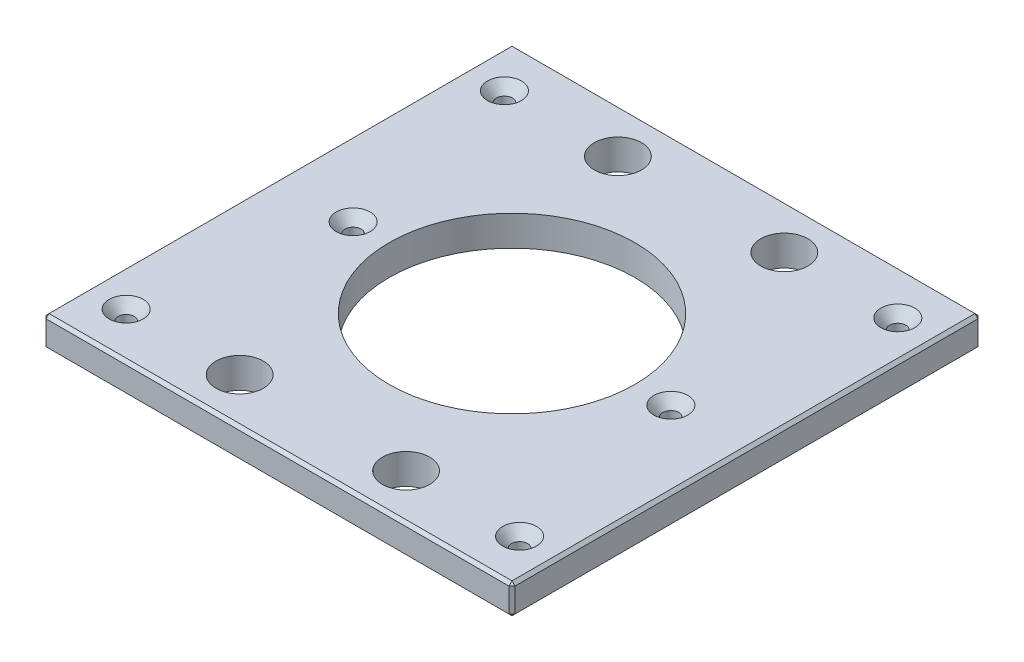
ISO-10303-21;
HEADER;
FILE_DESCRIPTION(('STEP AP214'),'2;1');
FILE_NAME('part.step','',(''),(''),'','','');
FILE_SCHEMA(('AUTOMOTIVE_DESIGN { 1 0 10303 214 1 1 1 1 }'));
ENDSEC;
DATA;
#1=APPLICATION_CONTEXT('core data for automotive mechanical design processes');
#2=APPLICATION_PROTOCOL_DEFINITION('international standard','automotive_design',2000,#1);
#3=PRODUCT_CONTEXT('',#1,'mechanical');
#4=PRODUCT('Part','Part','',(#3));
#5=PRODUCT_RELATED_PRODUCT_CATEGORY('part','',(#4));
#6=PRODUCT_DEFINITION_FORMATION('','',#4);
#7=PRODUCT_DEFINITION_CONTEXT('part definition',#1,'design');
#8=PRODUCT_DEFINITION('design','',#6,#7);
#9=PRODUCT_DEFINITION_SHAPE('','',#8);
#10=(LENGTH_UNIT() NAMED_UNIT(*) SI_UNIT(.MILLI.,.METRE.));
#11=(NAMED_UNIT(*) PLANE_ANGLE_UNIT() SI_UNIT($,.RADIAN.));
#12=(NAMED_UNIT(*) SI_UNIT($,.STERADIAN.) SOLID_ANGLE_UNIT());
#13=UNCERTAINTY_MEASURE_WITH_UNIT(LENGTH_MEASURE(1.E-05),#10,'distance_accuracy_value','');
#14=(GEOMETRIC_REPRESENTATION_CONTEXT(3) GLOBAL_UNCERTAINTY_ASSIGNED_CONTEXT((#13)) GLOBAL_UNIT_ASSIGNED_CONTEXT((#10,
#11,#12)) REPRESENTATION_CONTEXT('',''));
#15=CARTESIAN_POINT('',(0.,0.,0.));
#16=DIRECTION('',(0.,0.,1.));
#17=DIRECTION('',(1.,0.,0.));
#18=AXIS2_PLACEMENT_3D('',#15,#16,#17);
#19=CARTESIAN_POINT('',(-98.425,12.7,-98.425));
#20=DIRECTION('',(1.,0.,0.));
#21=DIRECTION('',(0.,0.,-1.));
#22=AXIS2_PLACEMENT_3D('',#19,#20,#21);
#23=PLANE('',#22);
#24=DIRECTION('',(0.,0.,-1.));
#25=VECTOR('',#24,1.);
#26=CARTESIAN_POINT('',(-98.425,11.43,-98.425));
#27=LINE('',#26,#25);
#28=CARTESIAN_POINT('',(-98.425,11.43,97.155));
#29=VERTEX_POINT('',#28);
#30=CARTESIAN_POINT('',(-98.425,11.43,-97.155));
#31=VERTEX_POINT('',#30);
#32=EDGE_CURVE('E142',#29,#31,#27,.T.);
#33=ORIENTED_EDGE('',*,*,#32,.T.);
#34=DIRECTION('',(0.,-1.,0.));
#35=VECTOR('',#34,1.);
#36=CARTESIAN_POINT('',(-98.425,12.7,-97.155));
#37=LINE('',#36,#35);
#38=CARTESIAN_POINT('',(-98.425,1.26999999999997,-97.155));
#39=VERTEX_POINT('',#38);
#40=EDGE_CURVE('E137',#31,#39,#37,.T.);
#41=ORIENTED_EDGE('',*,*,#40,.T.);
#42=DIRECTION('',(0.,0.,1.));
#43=VECTOR('',#42,1.);
#44=CARTESIAN_POINT('',(-98.425,1.26999999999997,-98.425));
#45=LINE('',#44,#43);
#46=CARTESIAN_POINT('',(-98.425,1.26999999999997,97.155));
#47=VERTEX_POINT('',#46);
#48=EDGE_CURVE('E132',#39,#47,#45,.T.);
#49=ORIENTED_EDGE('',*,*,#48,.T.);
#50=DIRECTION('',(0.,1.,0.));
#51=VECTOR('',#50,1.);
#52=CARTESIAN_POINT('',(-98.425,12.7,97.155));
#53=LINE('',#52,#51);
#54=EDGE_CURVE('E134',#47,#29,#53,.T.);
#55=ORIENTED_EDGE('',*,*,#54,.T.);
#56=EDGE_LOOP('',(#33,#41,#49,#55));
#57=FACE_BOUND('',#56,.T.);
#58=ADVANCED_FACE('F40',(#57),#23,.F.);
#59=CARTESIAN_POINT('',(-98.425,12.7,98.425));
#60=DIRECTION('',(0.,0.,-1.));
#61=DIRECTION('',(-1.,0.,0.));
#62=AXIS2_PLACEMENT_3D('',#59,#60,#61);
#63=PLANE('',#62);
#64=DIRECTION('',(1.,0.,0.));
#65=VECTOR('',#64,1.);
#66=CARTESIAN_POINT('',(-98.425,1.26999999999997,98.425));
#67=LINE('',#66,#65);
#68=CARTESIAN_POINT('',(-97.1550000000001,1.26999999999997,98.425));
#69=VERTEX_POINT('',#68);
#70=CARTESIAN_POINT('',(97.1550000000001,1.26999999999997,98.425));
#71=VERTEX_POINT('',#70);
#72=EDGE_CURVE('E64',#69,#71,#67,.T.);
#73=ORIENTED_EDGE('',*,*,#72,.T.);
#74=DIRECTION('',(0.,1.,0.));
#75=VECTOR('',#74,1.);
#76=CARTESIAN_POINT('',(97.1550000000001,12.7,98.425));
#77=LINE('',#76,#75);
#78=CARTESIAN_POINT('',(97.1550000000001,11.43,98.425));
#79=VERTEX_POINT('',#78);
#80=EDGE_CURVE('E11',#71,#79,#77,.T.);
#81=ORIENTED_EDGE('',*,*,#80,.T.);
#82=DIRECTION('',(-1.,0.,0.));
#83=VECTOR('',#82,1.);
#84=CARTESIAN_POINT('',(-98.425,11.43,98.425));
#85=LINE('',#84,#83);
#86=CARTESIAN_POINT('',(-97.1550000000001,11.43,98.425));
#87=VERTEX_POINT('',#86);
#88=EDGE_CURVE('E50',#79,#87,#85,.T.);
#89=ORIENTED_EDGE('',*,*,#88,.T.);
#90=DIRECTION('',(0.,-1.,0.));
#91=VECTOR('',#90,1.);
#92=CARTESIAN_POINT('',(-97.1550000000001,12.7,98.425));
#93=LINE('',#92,#91);
#94=EDGE_CURVE('E333',#87,#69,#93,.T.);
#95=ORIENTED_EDGE('',*,*,#94,.T.);
#96=EDGE_LOOP('',(#73,#81,#89,#95));
#97=FACE_BOUND('',#96,.T.);
#98=ADVANCED_FACE('F411',(#97),#63,.F.);
#99=CARTESIAN_POINT('',(98.425,12.7,-98.425));
#100=DIRECTION('',(-1.,0.,0.));
#101=DIRECTION('',(0.,0.,1.));
#102=AXIS2_PLACEMENT_3D('',#99,#100,#101);
#103=PLANE('',#102);
#104=DIRECTION('',(0.,0.,-1.));
#105=VECTOR('',#104,1.);
#106=CARTESIAN_POINT('',(98.425,1.26999999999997,-98.425));
#107=LINE('',#106,#105);
#108=CARTESIAN_POINT('',(98.425,1.26999999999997,97.155));
#109=VERTEX_POINT('',#108);
#110=CARTESIAN_POINT('',(98.425,1.26999999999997,-97.155));
#111=VERTEX_POINT('',#110);
#112=EDGE_CURVE('E326',#109,#111,#107,.T.);
#113=ORIENTED_EDGE('',*,*,#112,.T.);
#114=DIRECTION('',(0.,1.,0.));
#115=VECTOR('',#114,1.);
#116=CARTESIAN_POINT('',(98.425,12.7,-97.155));
#117=LINE('',#116,#115);
#118=CARTESIAN_POINT('',(98.425,11.43,-97.155));
#119=VERTEX_POINT('',#118);
#120=EDGE_CURVE('E329',#111,#119,#117,.T.);
#121=ORIENTED_EDGE('',*,*,#120,.T.);
#122=DIRECTION('',(0.,0.,1.));
#123=VECTOR('',#122,1.);
#124=CARTESIAN_POINT('',(98.425,11.43,98.425));
#125=LINE('',#124,#123);
#126=CARTESIAN_POINT('',(98.425,11.43,97.155));
#127=VERTEX_POINT('',#126);
#128=EDGE_CURVE('E323',#119,#127,#125,.T.);
#129=ORIENTED_EDGE('',*,*,#128,.T.);
#130=DIRECTION('',(0.,-1.,0.));
#131=VECTOR('',#130,1.);
#132=CARTESIAN_POINT('',(98.425,12.7,97.155));
#133=LINE('',#132,#131);
#134=EDGE_CURVE('E320',#127,#109,#133,.T.);
#135=ORIENTED_EDGE('',*,*,#134,.T.);
#136=EDGE_LOOP('',(#113,#121,#129,#135));
#137=FACE_BOUND('',#136,.T.);
#138=ADVANCED_FACE('F398',(#137),#103,.F.);
#139=CARTESIAN_POINT('',(-98.425,12.7,-98.425));
#140=DIRECTION('',(0.,0.,1.));
#141=DIRECTION('',(1.,0.,0.));
#142=AXIS2_PLACEMENT_3D('',#139,#140,#141);
#143=PLANE('',#142);
#144=DIRECTION('',(-1.,0.,0.));
#145=VECTOR('',#144,1.);
#146=CARTESIAN_POINT('',(-98.425,1.26999999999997,-98.425));
#147=LINE('',#146,#145);
#148=CARTESIAN_POINT('',(97.1550000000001,1.26999999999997,-98.425));
#149=VERTEX_POINT('',#148);
#150=CARTESIAN_POINT('',(-97.1550000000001,1.26999999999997,-98.425));
#151=VERTEX_POINT('',#150);
#152=EDGE_CURVE('E287',#149,#151,#147,.T.);
#153=ORIENTED_EDGE('',*,*,#152,.T.);
#154=DIRECTION('',(0.,1.,0.));
#155=VECTOR('',#154,1.);
#156=CARTESIAN_POINT('',(-97.1550000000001,12.7,-98.425));
#157=LINE('',#156,#155);
#158=CARTESIAN_POINT('',(-97.1550000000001,11.43,-98.425));
#159=VERTEX_POINT('',#158);
#160=EDGE_CURVE('E293',#151,#159,#157,.T.);
#161=ORIENTED_EDGE('',*,*,#160,.T.);
#162=DIRECTION('',(1.,0.,0.));
#163=VECTOR('',#162,1.);
#164=CARTESIAN_POINT('',(98.425,11.43,-98.425));
#165=LINE('',#164,#163);
#166=CARTESIAN_POINT('',(97.1550000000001,11.43,-98.425));
#167=VERTEX_POINT('',#166);
#168=EDGE_CURVE('E290',#159,#167,#165,.T.);
#169=ORIENTED_EDGE('',*,*,#168,.T.);
#170=DIRECTION('',(0.,-1.,0.));
#171=VECTOR('',#170,1.);
#172=CARTESIAN_POINT('',(97.1550000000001,12.7,-98.425));
#173=LINE('',#172,#171);
#174=EDGE_CURVE('E284',#167,#149,#173,.T.);
#175=ORIENTED_EDGE('',*,*,#174,.T.);
#176=EDGE_LOOP('',(#153,#161,#169,#175));
#177=FACE_BOUND('',#176,.T.);
#178=ADVANCED_FACE('F372',(#177),#143,.F.);
#179=CARTESIAN_POINT('',(0.,12.7,0.));
#180=DIRECTION('',(0.,1.,0.));
#181=DIRECTION('',(0.,0.,1.));
#182=AXIS2_PLACEMENT_3D('',#179,#180,#181);
#183=PLANE('',#182);
#184=CARTESIAN_POINT('',(82.55,12.7,-79.375));
#185=DIRECTION('',(0.,1.,0.));
#186=DIRECTION('',(0.,0.,1.));
#187=AXIS2_PLACEMENT_3D('',#184,#185,#186);
#188=CIRCLE('',#187,7.1374);
#189=CARTESIAN_POINT('',(82.55,12.7,-72.2376));
#190=VERTEX_POINT('',#189);
#191=EDGE_CURVE('E879',#190,#190,#188,.T.);
#192=ORIENTED_EDGE('',*,*,#191,.F.);
#193=EDGE_LOOP('',(#192));
#194=FACE_BOUND('',#193,.T.);
#195=CARTESIAN_POINT('',(82.55,12.7,79.375));
#196=DIRECTION('',(0.,1.,0.));
#197=DIRECTION('',(0.,0.,1.));
#198=AXIS2_PLACEMENT_3D('',#195,#196,#197);
#199=CIRCLE('',#198,7.1374);
#200=CARTESIAN_POINT('',(82.55,12.7,86.5124));
#201=VERTEX_POINT('',#200);
#202=EDGE_CURVE('E883',#201,#201,#199,.T.);
#203=ORIENTED_EDGE('',*,*,#202,.F.);
#204=EDGE_LOOP('',(#203));
#205=FACE_BOUND('',#204,.T.);
#206=CARTESIAN_POINT('',(-82.55,12.7,79.375));
#207=DIRECTION('',(0.,1.,0.));
#208=DIRECTION('',(0.,0.,1.));
#209=AXIS2_PLACEMENT_3D('',#206,#207,#208);
#210=CIRCLE('',#209,7.1374);
#211=CARTESIAN_POINT('',(-82.55,12.7,86.5124));
#212=VERTEX_POINT('',#211);
#213=EDGE_CURVE('E887',#212,#212,#210,.T.);
#214=ORIENTED_EDGE('',*,*,#213,.F.);
#215=EDGE_LOOP('',(#214));
#216=FACE_BOUND('',#215,.T.);
#217=CARTESIAN_POINT('',(-66.675,12.7,0.));
#218=DIRECTION('',(0.,1.,0.));
#219=DIRECTION('',(0.,0.,1.));
#220=AXIS2_PLACEMENT_3D('',#217,#218,#219);
#221=CIRCLE('',#220,7.1374);
#222=CARTESIAN_POINT('',(-66.675,12.7,7.1374));
#223=VERTEX_POINT('',#222);
#224=EDGE_CURVE('E891',#223,#223,#221,.T.);
#225=ORIENTED_EDGE('',*,*,#224,.F.);
#226=EDGE_LOOP('',(#225));
#227=FACE_BOUND('',#226,.T.);
#228=CARTESIAN_POINT('',(66.675,12.7,0.));
#229=DIRECTION('',(0.,1.,0.));
#230=DIRECTION('',(0.,0.,1.));
#231=AXIS2_PLACEMENT_3D('',#228,#229,#230);
#232=CIRCLE('',#231,7.1374);
#233=CARTESIAN_POINT('',(66.675,12.7,7.1374));
#234=VERTEX_POINT('',#233);
#235=EDGE_CURVE('E895',#234,#234,#232,.T.);
#236=ORIENTED_EDGE('',*,*,#235,.F.);
#237=EDGE_LOOP('',(#236));
#238=FACE_BOUND('',#237,.T.);
#239=CARTESIAN_POINT('',(-82.55,12.7,-79.375));
#240=DIRECTION('',(0.,1.,0.));
#241=DIRECTION('',(0.,0.,1.));
#242=AXIS2_PLACEMENT_3D('',#239,#240,#241);
#243=CIRCLE('',#242,7.1374);
#244=CARTESIAN_POINT('',(-82.55,12.7,-72.2376));
#245=VERTEX_POINT('',#244);
#246=EDGE_CURVE('E898',#245,#245,#243,.T.);
#247=ORIENTED_EDGE('',*,*,#246,.F.);
#248=EDGE_LOOP('',(#247));
#249=FACE_BOUND('',#248,.T.);
#250=DIRECTION('',(0.,0.,-1.));
#251=VECTOR('',#250,1.);
#252=CARTESIAN_POINT('',(97.1550000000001,12.7,-98.425));
#253=LINE('',#252,#251);
#254=CARTESIAN_POINT('',(97.1550000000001,12.7,97.155));
#255=VERTEX_POINT('',#254);
#256=CARTESIAN_POINT('',(97.1550000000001,12.7,-97.155));
#257=VERTEX_POINT('',#256);
#258=EDGE_CURVE('E302',#255,#257,#253,.T.);
#259=ORIENTED_EDGE('',*,*,#258,.T.);
#260=DIRECTION('',(-1.,0.,0.));
#261=VECTOR('',#260,1.);
#262=CARTESIAN_POINT('',(-98.425,12.7,-97.155));
#263=LINE('',#262,#261);
#264=CARTESIAN_POINT('',(-97.1550000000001,12.7,-97.155));
#265=VERTEX_POINT('',#264);
#266=EDGE_CURVE('E305',#257,#265,#263,.T.);
#267=ORIENTED_EDGE('',*,*,#266,.T.);
#268=DIRECTION('',(0.,0.,1.));
#269=VECTOR('',#268,1.);
#270=CARTESIAN_POINT('',(-97.1550000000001,12.7,98.425));
#271=LINE('',#270,#269);
#272=CARTESIAN_POINT('',(-97.1550000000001,12.7,97.155));
#273=VERTEX_POINT('',#272);
#274=EDGE_CURVE('E299',#265,#273,#271,.T.);
#275=ORIENTED_EDGE('',*,*,#274,.T.);
#276=DIRECTION('',(1.,0.,0.));
#277=VECTOR('',#276,1.);
#278=CARTESIAN_POINT('',(98.425,12.7,97.155));
#279=LINE('',#278,#277);
#280=EDGE_CURVE('E296',#273,#255,#279,.T.);
#281=ORIENTED_EDGE('',*,*,#280,.T.);
#282=EDGE_LOOP('',(#259,#267,#275,#281));
#283=FACE_BOUND('',#282,.T.);
#284=CARTESIAN_POINT('',(34.925,12.7,-79.375));
#285=DIRECTION('',(0.,1.,0.));
#286=DIRECTION('',(0.,0.,1.));
#287=AXIS2_PLACEMENT_3D('',#284,#285,#286);
#288=CIRCLE('',#287,9.921875);
#289=CARTESIAN_POINT('',(34.925,12.7,-69.453125));
#290=VERTEX_POINT('',#289);
#291=EDGE_CURVE('E232',#290,#290,#288,.T.);
#292=ORIENTED_EDGE('',*,*,#291,.F.);
#293=EDGE_LOOP('',(#292));
#294=FACE_BOUND('',#293,.T.);
#295=CARTESIAN_POINT('',(-34.925,12.7,-79.375));
#296=DIRECTION('',(0.,1.,0.));
#297=DIRECTION('',(0.,0.,1.));
#298=AXIS2_PLACEMENT_3D('',#295,#296,#297);
#299=CIRCLE('',#298,9.921875);
#300=CARTESIAN_POINT('',(-34.925,12.7,-69.453125));
#301=VERTEX_POINT('',#300);
#302=EDGE_CURVE('E247',#301,#301,#299,.T.);
#303=ORIENTED_EDGE('',*,*,#302,.F.);
#304=EDGE_LOOP('',(#303));
#305=FACE_BOUND('',#304,.T.);
#306=CARTESIAN_POINT('',(34.925,12.7,79.375));
#307=DIRECTION('',(0.,1.,0.));
#308=DIRECTION('',(0.,0.,1.));
#309=AXIS2_PLACEMENT_3D('',#306,#307,#308);
#310=CIRCLE('',#309,9.921875);
#311=CARTESIAN_POINT('',(34.925,12.7,89.296875));
#312=VERTEX_POINT('',#311);
#313=EDGE_CURVE('E260',#312,#312,#310,.T.);
#314=ORIENTED_EDGE('',*,*,#313,.F.);
#315=EDGE_LOOP('',(#314));
#316=FACE_BOUND('',#315,.T.);
#317=CARTESIAN_POINT('',(-34.925,12.7,79.375));
#318=DIRECTION('',(0.,1.,0.));
#319=DIRECTION('',(0.,0.,1.));
#320=AXIS2_PLACEMENT_3D('',#317,#318,#319);
#321=CIRCLE('',#320,9.921875);
#322=CARTESIAN_POINT('',(-34.925,12.7,89.296875));
#323=VERTEX_POINT('',#322);
#324=EDGE_CURVE('E267',#323,#323,#321,.T.);
#325=ORIENTED_EDGE('',*,*,#324,.F.);
#326=EDGE_LOOP('',(#325));
#327=FACE_BOUND('',#326,.T.);
#328=CARTESIAN_POINT('',(0.,12.7,0.));
#329=DIRECTION('',(0.,1.,0.));
#330=DIRECTION('',(0.,0.,1.));
#331=AXIS2_PLACEMENT_3D('',#328,#329,#330);
#332=CIRCLE('',#331,51.562);
#333=CARTESIAN_POINT('',(0.,12.7,51.562));
#334=VERTEX_POINT('',#333);
#335=EDGE_CURVE('E274',#334,#334,#332,.T.);
#336=ORIENTED_EDGE('',*,*,#335,.F.);
#337=EDGE_LOOP('',(#336));
#338=FACE_BOUND('',#337,.T.);
#339=ADVANCED_FACE('F420',(#194,#205,#216,#227,#238,#249,#283,#294,#305,#316,#327,#338),#183,.T.);
#340=CARTESIAN_POINT('',(0.,0.,0.));
#341=DIRECTION('',(0.,1.,0.));
#342=DIRECTION('',(0.,0.,1.));
#343=AXIS2_PLACEMENT_3D('',#340,#341,#342);
#344=PLANE('',#343);
#345=CARTESIAN_POINT('',(82.55,0.,-79.375));
#346=DIRECTION('',(0.,1.,0.));
#347=DIRECTION('',(0.,0.,1.));
#348=AXIS2_PLACEMENT_3D('',#345,#346,#347);
#349=CIRCLE('',#348,3.3782);
#350=CARTESIAN_POINT('',(82.55,0.,-75.9968));
#351=VERTEX_POINT('',#350);
#352=EDGE_CURVE('E946',#351,#351,#349,.T.);
#353=ORIENTED_EDGE('',*,*,#352,.T.);
#354=EDGE_LOOP('',(#353));
#355=FACE_BOUND('',#354,.T.);
#356=CARTESIAN_POINT('',(82.55,0.,79.375));
#357=DIRECTION('',(0.,1.,0.));
#358=DIRECTION('',(0.,0.,1.));
#359=AXIS2_PLACEMENT_3D('',#356,#357,#358);
#360=CIRCLE('',#359,3.3782);
#361=CARTESIAN_POINT('',(82.55,0.,82.7532));
#362=VERTEX_POINT('',#361);
#363=EDGE_CURVE('E937',#362,#362,#360,.T.);
#364=ORIENTED_EDGE('',*,*,#363,.T.);
#365=EDGE_LOOP('',(#364));
#366=FACE_BOUND('',#365,.T.);
#367=CARTESIAN_POINT('',(-82.55,0.,79.375));
#368=DIRECTION('',(0.,1.,0.));
#369=DIRECTION('',(0.,0.,1.));
#370=AXIS2_PLACEMENT_3D('',#367,#368,#369);
#371=CIRCLE('',#370,3.3782);
#372=CARTESIAN_POINT('',(-82.55,0.,82.7532));
#373=VERTEX_POINT('',#372);
#374=EDGE_CURVE('E927',#373,#373,#371,.T.);
#375=ORIENTED_EDGE('',*,*,#374,.T.);
#376=EDGE_LOOP('',(#375));
#377=FACE_BOUND('',#376,.T.);
#378=CARTESIAN_POINT('',(-66.675,0.,0.));
#379=DIRECTION('',(0.,1.,0.));
#380=DIRECTION('',(0.,0.,1.));
#381=AXIS2_PLACEMENT_3D('',#378,#379,#380);
#382=CIRCLE('',#381,3.3782);
#383=CARTESIAN_POINT('',(-66.675,0.,3.3782));
#384=VERTEX_POINT('',#383);
#385=EDGE_CURVE('E917',#384,#384,#382,.T.);
#386=ORIENTED_EDGE('',*,*,#385,.T.);
#387=EDGE_LOOP('',(#386));
#388=FACE_BOUND('',#387,.T.);
#389=CARTESIAN_POINT('',(66.675,0.,0.));
#390=DIRECTION('',(0.,1.,0.));
#391=DIRECTION('',(0.,0.,1.));
#392=AXIS2_PLACEMENT_3D('',#389,#390,#391);
#393=CIRCLE('',#392,3.3782);
#394=CARTESIAN_POINT('',(66.675,0.,3.3782));
#395=VERTEX_POINT('',#394);
#396=EDGE_CURVE('E902',#395,#395,#393,.T.);
#397=ORIENTED_EDGE('',*,*,#396,.T.);
#398=EDGE_LOOP('',(#397));
#399=FACE_BOUND('',#398,.T.);
#400=CARTESIAN_POINT('',(-82.55,0.,-79.375));
#401=DIRECTION('',(0.,1.,0.));
#402=DIRECTION('',(0.,0.,1.));
#403=AXIS2_PLACEMENT_3D('',#400,#401,#402);
#404=CIRCLE('',#403,3.3782);
#405=CARTESIAN_POINT('',(-82.55,0.,-75.9968));
#406=VERTEX_POINT('',#405);
#407=EDGE_CURVE('E250',#406,#406,#404,.T.);
#408=ORIENTED_EDGE('',*,*,#407,.T.);
#409=EDGE_LOOP('',(#408));
#410=FACE_BOUND('',#409,.T.);
#411=DIRECTION('',(0.,0.,-1.));
#412=VECTOR('',#411,1.);
#413=CARTESIAN_POINT('',(-97.1550000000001,0.,0.));
#414=LINE('',#413,#412);
#415=CARTESIAN_POINT('',(-97.1550000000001,0.,97.155));
#416=VERTEX_POINT('',#415);
#417=CARTESIAN_POINT('',(-97.1550000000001,0.,-97.155));
#418=VERTEX_POINT('',#417);
#419=EDGE_CURVE('E167',#416,#418,#414,.T.);
#420=ORIENTED_EDGE('',*,*,#419,.T.);
#421=DIRECTION('',(1.,0.,0.));
#422=VECTOR('',#421,1.);
#423=CARTESIAN_POINT('',(0.,0.,-97.155));
#424=LINE('',#423,#422);
#425=CARTESIAN_POINT('',(97.1550000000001,0.,-97.155));
#426=VERTEX_POINT('',#425);
#427=EDGE_CURVE('E317',#418,#426,#424,.T.);
#428=ORIENTED_EDGE('',*,*,#427,.T.);
#429=DIRECTION('',(0.,0.,1.));
#430=VECTOR('',#429,1.);
#431=CARTESIAN_POINT('',(97.1550000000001,0.,0.));
#432=LINE('',#431,#430);
#433=CARTESIAN_POINT('',(97.1550000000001,0.,97.155));
#434=VERTEX_POINT('',#433);
#435=EDGE_CURVE('E314',#426,#434,#432,.T.);
#436=ORIENTED_EDGE('',*,*,#435,.T.);
#437=DIRECTION('',(-1.,0.,0.));
#438=VECTOR('',#437,1.);
#439=CARTESIAN_POINT('',(0.,0.,97.155));
#440=LINE('',#439,#438);
#441=EDGE_CURVE('E309',#434,#416,#440,.T.);
#442=ORIENTED_EDGE('',*,*,#441,.T.);
#443=EDGE_LOOP('',(#420,#428,#436,#442));
#444=FACE_BOUND('',#443,.T.);
#445=CARTESIAN_POINT('',(34.925,0.,-79.375));
#446=DIRECTION('',(0.,1.,0.));
#447=DIRECTION('',(0.,0.,1.));
#448=AXIS2_PLACEMENT_3D('',#445,#446,#447);
#449=CIRCLE('',#448,9.921875);
#450=CARTESIAN_POINT('',(34.925,0.,-69.453125));
#451=VERTEX_POINT('',#450);
#452=EDGE_CURVE('E239',#451,#451,#449,.T.);
#453=ORIENTED_EDGE('',*,*,#452,.T.);
#454=EDGE_LOOP('',(#453));
#455=FACE_BOUND('',#454,.T.);
#456=CARTESIAN_POINT('',(-34.925,0.,-79.375));
#457=DIRECTION('',(0.,1.,0.));
#458=DIRECTION('',(0.,0.,1.));
#459=AXIS2_PLACEMENT_3D('',#456,#457,#458);
#460=CIRCLE('',#459,9.921875);
#461=CARTESIAN_POINT('',(-34.925,0.,-69.453125));
#462=VERTEX_POINT('',#461);
#463=EDGE_CURVE('E256',#462,#462,#460,.T.);
#464=ORIENTED_EDGE('',*,*,#463,.T.);
#465=EDGE_LOOP('',(#464));
#466=FACE_BOUND('',#465,.T.);
#467=CARTESIAN_POINT('',(34.925,0.,79.375));
#468=DIRECTION('',(0.,1.,0.));
#469=DIRECTION('',(0.,0.,1.));
#470=AXIS2_PLACEMENT_3D('',#467,#468,#469);
#471=CIRCLE('',#470,9.921875);
#472=CARTESIAN_POINT('',(34.925,0.,89.296875));
#473=VERTEX_POINT('',#472);
#474=EDGE_CURVE('E263',#473,#473,#471,.T.);
#475=ORIENTED_EDGE('',*,*,#474,.T.);
#476=EDGE_LOOP('',(#475));
#477=FACE_BOUND('',#476,.T.);
#478=CARTESIAN_POINT('',(-34.925,0.,79.375));
#479=DIRECTION('',(0.,1.,0.));
#480=DIRECTION('',(0.,0.,1.));
#481=AXIS2_PLACEMENT_3D('',#478,#479,#480);
#482=CIRCLE('',#481,9.921875);
#483=CARTESIAN_POINT('',(-34.925,0.,89.296875));
#484=VERTEX_POINT('',#483);
#485=EDGE_CURVE('E270',#484,#484,#482,.T.);
#486=ORIENTED_EDGE('',*,*,#485,.T.);
#487=EDGE_LOOP('',(#486));
#488=FACE_BOUND('',#487,.T.);
#489=CARTESIAN_POINT('',(0.,0.,0.));
#490=DIRECTION('',(0.,1.,0.));
#491=DIRECTION('',(0.,0.,1.));
#492=AXIS2_PLACEMENT_3D('',#489,#490,#491);
#493=CIRCLE('',#492,51.562);
#494=CARTESIAN_POINT('',(0.,0.,51.562));
#495=VERTEX_POINT('',#494);
#496=EDGE_CURVE('E155',#495,#495,#493,.T.);
#497=ORIENTED_EDGE('',*,*,#496,.T.);
#498=EDGE_LOOP('',(#497));
#499=FACE_BOUND('',#498,.T.);
#500=ADVANCED_FACE('F385',(#355,#366,#377,#388,#399,#410,#444,#455,#466,#477,#488,#499),#344,.F.);
#501=CARTESIAN_POINT('',(0.,0.,0.));
#502=DIRECTION('',(0.,1.,0.));
#503=DIRECTION('',(0.,0.,1.));
#504=AXIS2_PLACEMENT_3D('',#501,#502,#503);
#505=CYLINDRICAL_SURFACE('',#504,51.562);
#506=ORIENTED_EDGE('',*,*,#496,.F.);
#507=EDGE_LOOP('',(#506));
#508=FACE_BOUND('',#507,.T.);
#509=ORIENTED_EDGE('',*,*,#335,.T.);
#510=EDGE_LOOP('',(#509));
#511=FACE_BOUND('',#510,.T.);
#512=ADVANCED_FACE('F666',(#508,#511),#505,.F.);
#513=CARTESIAN_POINT('',(-34.925,12.7,79.375));
#514=DIRECTION('',(0.,1.,0.));
#515=DIRECTION('',(0.,0.,1.));
#516=AXIS2_PLACEMENT_3D('',#513,#514,#515);
#517=CYLINDRICAL_SURFACE('',#516,9.921875);
#518=ORIENTED_EDGE('',*,*,#485,.F.);
#519=EDGE_LOOP('',(#518));
#520=FACE_BOUND('',#519,.T.);
#521=ORIENTED_EDGE('',*,*,#324,.T.);
#522=EDGE_LOOP('',(#521));
#523=FACE_BOUND('',#522,.T.);
#524=ADVANCED_FACE('F820',(#520,#523),#517,.F.);
#525=CARTESIAN_POINT('',(34.925,12.7,79.375));
#526=DIRECTION('',(0.,1.,0.));
#527=DIRECTION('',(0.,0.,1.));
#528=AXIS2_PLACEMENT_3D('',#525,#526,#527);
#529=CYLINDRICAL_SURFACE('',#528,9.921875);
#530=ORIENTED_EDGE('',*,*,#474,.F.);
#531=EDGE_LOOP('',(#530));
#532=FACE_BOUND('',#531,.T.);
#533=ORIENTED_EDGE('',*,*,#313,.T.);
#534=EDGE_LOOP('',(#533));
#535=FACE_BOUND('',#534,.T.);
#536=ADVANCED_FACE('F810',(#532,#535),#529,.F.);
#537=CARTESIAN_POINT('',(-34.925,12.7,-79.375));
#538=DIRECTION('',(0.,1.,0.));
#539=DIRECTION('',(0.,0.,1.));
#540=AXIS2_PLACEMENT_3D('',#537,#538,#539);
#541=CYLINDRICAL_SURFACE('',#540,9.921875);
#542=ORIENTED_EDGE('',*,*,#463,.F.);
#543=EDGE_LOOP('',(#542));
#544=FACE_BOUND('',#543,.T.);
#545=ORIENTED_EDGE('',*,*,#302,.T.);
#546=EDGE_LOOP('',(#545));
#547=FACE_BOUND('',#546,.T.);
#548=ADVANCED_FACE('F800',(#544,#547),#541,.F.);
#549=CARTESIAN_POINT('',(34.925,12.7,-79.375));
#550=DIRECTION('',(0.,1.,0.));
#551=DIRECTION('',(0.,0.,1.));
#552=AXIS2_PLACEMENT_3D('',#549,#550,#551);
#553=CYLINDRICAL_SURFACE('',#552,9.921875);
#554=ORIENTED_EDGE('',*,*,#452,.F.);
#555=EDGE_LOOP('',(#554));
#556=FACE_BOUND('',#555,.T.);
#557=ORIENTED_EDGE('',*,*,#291,.T.);
#558=EDGE_LOOP('',(#557));
#559=FACE_BOUND('',#558,.T.);
#560=ADVANCED_FACE('F429',(#556,#559),#553,.F.);
#561=CARTESIAN_POINT('',(98.425,12.7,97.155));
#562=DIRECTION('',(-0.707106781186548,0.,-0.707106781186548));
#563=DIRECTION('',(0.,-1.,0.));
#564=AXIS2_PLACEMENT_3D('',#561,#562,#563);
#565=PLANE('',#564);
#566=DIRECTION('',(-0.707106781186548,0.,0.707106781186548));
#567=VECTOR('',#566,1.);
#568=CARTESIAN_POINT('',(98.425,11.43,97.155));
#569=LINE('',#568,#567);
#570=EDGE_CURVE('E44',#79,#127,#569,.F.);
#571=ORIENTED_EDGE('',*,*,#570,.F.);
#572=ORIENTED_EDGE('',*,*,#80,.F.);
#573=DIRECTION('',(0.707106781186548,0.,-0.707106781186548));
#574=VECTOR('',#573,1.);
#575=CARTESIAN_POINT('',(97.7900000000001,1.26999999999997,97.79));
#576=LINE('',#575,#574);
#577=EDGE_CURVE('E221',#109,#71,#576,.F.);
#578=ORIENTED_EDGE('',*,*,#577,.F.);
#579=ORIENTED_EDGE('',*,*,#134,.F.);
#580=EDGE_LOOP('',(#571,#572,#578,#579));
#581=FACE_BOUND('',#580,.T.);
#582=ADVANCED_FACE('F42',(#581),#565,.F.);
#583=CARTESIAN_POINT('',(98.425,11.43,97.155));
#584=DIRECTION('',(0.577350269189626,0.577350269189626,0.577350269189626));
#585=DIRECTION('',(0.707106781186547,0.,-0.707106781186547));
#586=AXIS2_PLACEMENT_3D('',#583,#584,#585);
#587=PLANE('',#586);
#588=DIRECTION('',(0.,-0.707106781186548,0.707106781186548));
#589=VECTOR('',#588,1.);
#590=CARTESIAN_POINT('',(97.1550000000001,12.065,97.79));
#591=LINE('',#590,#589);
#592=EDGE_CURVE('E216',#79,#255,#591,.F.);
#593=ORIENTED_EDGE('',*,*,#592,.F.);
#594=ORIENTED_EDGE('',*,*,#570,.T.);
#595=DIRECTION('',(-0.707106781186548,0.707106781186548,0.));
#596=VECTOR('',#595,1.);
#597=CARTESIAN_POINT('',(98.425,11.43,97.155));
#598=LINE('',#597,#596);
#599=EDGE_CURVE('E218',#255,#127,#598,.F.);
#600=ORIENTED_EDGE('',*,*,#599,.F.);
#601=EDGE_LOOP('',(#593,#594,#600));
#602=FACE_BOUND('',#601,.T.);
#603=ADVANCED_FACE('F422',(#602),#587,.T.);
#604=CARTESIAN_POINT('',(97.1550000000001,0.,97.155));
#605=DIRECTION('',(0.577350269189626,-0.577350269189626,0.577350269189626));
#606=DIRECTION('',(0.707106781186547,0.,-0.707106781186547));
#607=AXIS2_PLACEMENT_3D('',#604,#605,#606);
#608=PLANE('',#607);
#609=DIRECTION('',(-0.707106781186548,-0.707106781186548,0.));
#610=VECTOR('',#609,1.);
#611=CARTESIAN_POINT('',(97.1550000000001,0.,97.155));
#612=LINE('',#611,#610);
#613=EDGE_CURVE('E208',#109,#434,#612,.T.);
#614=ORIENTED_EDGE('',*,*,#613,.F.);
#615=ORIENTED_EDGE('',*,*,#577,.T.);
#616=DIRECTION('',(0.,0.707106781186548,0.707106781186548));
#617=VECTOR('',#616,1.);
#618=CARTESIAN_POINT('',(97.1550000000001,0.,97.155));
#619=LINE('',#618,#617);
#620=EDGE_CURVE('E212',#434,#71,#619,.T.);
#621=ORIENTED_EDGE('',*,*,#620,.F.);
#622=EDGE_LOOP('',(#614,#615,#621));
#623=FACE_BOUND('',#622,.T.);
#624=ADVANCED_FACE('F391',(#623),#608,.T.);
#625=CARTESIAN_POINT('',(97.1550000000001,12.7,0.));
#626=DIRECTION('',(0.707106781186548,0.707106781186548,0.));
#627=DIRECTION('',(0.,0.,1.));
#628=AXIS2_PLACEMENT_3D('',#625,#626,#627);
#629=PLANE('',#628);
#630=ORIENTED_EDGE('',*,*,#599,.T.);
#631=ORIENTED_EDGE('',*,*,#128,.F.);
#632=DIRECTION('',(0.707106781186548,-0.707106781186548,0.));
#633=VECTOR('',#632,1.);
#634=CARTESIAN_POINT('',(97.7900000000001,12.065,-97.155));
#635=LINE('',#634,#633);
#636=EDGE_CURVE('E202',#257,#119,#635,.T.);
#637=ORIENTED_EDGE('',*,*,#636,.F.);
#638=ORIENTED_EDGE('',*,*,#258,.F.);
#639=EDGE_LOOP('',(#630,#631,#637,#638));
#640=FACE_BOUND('',#639,.T.);
#641=ADVANCED_FACE('F408',(#640),#629,.T.);
#642=CARTESIAN_POINT('',(0.,12.7,97.155));
#643=DIRECTION('',(0.,0.707106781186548,0.707106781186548));
#644=DIRECTION('',(-1.,0.,0.));
#645=AXIS2_PLACEMENT_3D('',#642,#643,#644);
#646=PLANE('',#645);
#647=ORIENTED_EDGE('',*,*,#592,.T.);
#648=ORIENTED_EDGE('',*,*,#280,.F.);
#649=DIRECTION('',(0.,0.707106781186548,-0.707106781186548));
#650=VECTOR('',#649,1.);
#651=CARTESIAN_POINT('',(-97.1550000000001,12.7,97.155));
#652=LINE('',#651,#650);
#653=EDGE_CURVE('E198',#87,#273,#652,.T.);
#654=ORIENTED_EDGE('',*,*,#653,.F.);
#655=ORIENTED_EDGE('',*,*,#88,.F.);
#656=EDGE_LOOP('',(#647,#648,#654,#655));
#657=FACE_BOUND('',#656,.T.);
#658=ADVANCED_FACE('F413',(#657),#646,.T.);
#659=CARTESIAN_POINT('',(-97.1550000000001,12.7,98.425));
#660=DIRECTION('',(0.707106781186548,0.,-0.707106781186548));
#661=DIRECTION('',(0.,-1.,0.));
#662=AXIS2_PLACEMENT_3D('',#659,#660,#661);
#663=PLANE('',#662);
#664=DIRECTION('',(0.707106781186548,0.,0.707106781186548));
#665=VECTOR('',#664,1.);
#666=CARTESIAN_POINT('',(-98.425,1.26999999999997,97.155));
#667=LINE('',#666,#665);
#668=EDGE_CURVE('E149',#69,#47,#667,.F.);
#669=ORIENTED_EDGE('',*,*,#668,.F.);
#670=ORIENTED_EDGE('',*,*,#94,.F.);
#671=DIRECTION('',(-0.707106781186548,0.,-0.707106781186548));
#672=VECTOR('',#671,1.);
#673=CARTESIAN_POINT('',(-97.7900000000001,11.43,97.79));
#674=LINE('',#673,#672);
#675=EDGE_CURVE('E152',#29,#87,#674,.F.);
#676=ORIENTED_EDGE('',*,*,#675,.F.);
#677=ORIENTED_EDGE('',*,*,#54,.F.);
#678=EDGE_LOOP('',(#669,#670,#676,#677));
#679=FACE_BOUND('',#678,.T.);
#680=ADVANCED_FACE('F147',(#679),#663,.F.);
#681=CARTESIAN_POINT('',(-98.425,1.26999999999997,98.425));
#682=DIRECTION('',(0.,0.707106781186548,-0.707106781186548));
#683=DIRECTION('',(1.,0.,0.));
#684=AXIS2_PLACEMENT_3D('',#681,#682,#683);
#685=PLANE('',#684);
#686=ORIENTED_EDGE('',*,*,#620,.T.);
#687=ORIENTED_EDGE('',*,*,#72,.F.);
#688=DIRECTION('',(0.,-0.707106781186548,-0.707106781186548));
#689=VECTOR('',#688,1.);
#690=CARTESIAN_POINT('',(-97.1550000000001,0.634999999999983,97.79));
#691=LINE('',#690,#689);
#692=EDGE_CURVE('E163',#416,#69,#691,.F.);
#693=ORIENTED_EDGE('',*,*,#692,.F.);
#694=ORIENTED_EDGE('',*,*,#441,.F.);
#695=EDGE_LOOP('',(#686,#687,#693,#694));
#696=FACE_BOUND('',#695,.T.);
#697=ADVANCED_FACE('F390',(#696),#685,.F.);
#698=CARTESIAN_POINT('',(98.425,1.26999999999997,-98.425));
#699=DIRECTION('',(-0.707106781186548,0.707106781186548,0.));
#700=DIRECTION('',(0.,0.,-1.));
#701=AXIS2_PLACEMENT_3D('',#698,#699,#700);
#702=PLANE('',#701);
#703=ORIENTED_EDGE('',*,*,#613,.T.);
#704=ORIENTED_EDGE('',*,*,#435,.F.);
#705=DIRECTION('',(0.707106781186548,0.707106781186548,0.));
#706=VECTOR('',#705,1.);
#707=CARTESIAN_POINT('',(97.1550000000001,0.,-97.155));
#708=LINE('',#707,#706);
#709=EDGE_CURVE('E190',#111,#426,#708,.F.);
#710=ORIENTED_EDGE('',*,*,#709,.F.);
#711=ORIENTED_EDGE('',*,*,#112,.F.);
#712=EDGE_LOOP('',(#703,#704,#710,#711));
#713=FACE_BOUND('',#712,.T.);
#714=ADVANCED_FACE('F395',(#713),#702,.F.);
#715=CARTESIAN_POINT('',(97.1550000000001,12.7,-98.425));
#716=DIRECTION('',(-0.707106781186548,0.,0.707106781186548));
#717=DIRECTION('',(0.,-1.,0.));
#718=AXIS2_PLACEMENT_3D('',#715,#716,#717);
#719=PLANE('',#718);
#720=DIRECTION('',(0.707106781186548,0.,0.707106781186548));
#721=VECTOR('',#720,1.);
#722=CARTESIAN_POINT('',(97.1550000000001,11.43,-98.425));
#723=LINE('',#722,#721);
#724=EDGE_CURVE('E204',#119,#167,#723,.F.);
#725=ORIENTED_EDGE('',*,*,#724,.F.);
#726=ORIENTED_EDGE('',*,*,#120,.F.);
#727=DIRECTION('',(-0.707106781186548,0.,-0.707106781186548));
#728=VECTOR('',#727,1.);
#729=CARTESIAN_POINT('',(97.7900000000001,1.26999999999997,-97.79));
#730=LINE('',#729,#728);
#731=EDGE_CURVE('E186',#149,#111,#730,.F.);
#732=ORIENTED_EDGE('',*,*,#731,.F.);
#733=ORIENTED_EDGE('',*,*,#174,.F.);
#734=EDGE_LOOP('',(#725,#726,#732,#733));
#735=FACE_BOUND('',#734,.T.);
#736=ADVANCED_FACE('F403',(#735),#719,.F.);
#737=CARTESIAN_POINT('',(97.1550000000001,11.43,-98.425));
#738=DIRECTION('',(0.577350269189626,0.577350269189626,-0.577350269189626));
#739=DIRECTION('',(-0.707106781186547,0.,-0.707106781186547));
#740=AXIS2_PLACEMENT_3D('',#737,#738,#739);
#741=PLANE('',#740);
#742=ORIENTED_EDGE('',*,*,#636,.T.);
#743=ORIENTED_EDGE('',*,*,#724,.T.);
#744=DIRECTION('',(0.,0.707106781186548,0.707106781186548));
#745=VECTOR('',#744,1.);
#746=CARTESIAN_POINT('',(97.1550000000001,11.43,-98.425));
#747=LINE('',#746,#745);
#748=EDGE_CURVE('E176',#257,#167,#747,.F.);
#749=ORIENTED_EDGE('',*,*,#748,.F.);
#750=EDGE_LOOP('',(#742,#743,#749));
#751=FACE_BOUND('',#750,.T.);
#752=ADVANCED_FACE('F461',(#751),#741,.T.);
#753=CARTESIAN_POINT('',(-97.1550000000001,12.7,97.155));
#754=DIRECTION('',(-0.577350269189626,0.577350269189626,0.577350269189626));
#755=DIRECTION('',(0.707106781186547,0.,0.707106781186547));
#756=AXIS2_PLACEMENT_3D('',#753,#754,#755);
#757=PLANE('',#756);
#758=ORIENTED_EDGE('',*,*,#675,.T.);
#759=ORIENTED_EDGE('',*,*,#653,.T.);
#760=DIRECTION('',(-0.707106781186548,-0.707106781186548,0.));
#761=VECTOR('',#760,1.);
#762=CARTESIAN_POINT('',(-97.1550000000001,12.7,97.155));
#763=LINE('',#762,#761);
#764=EDGE_CURVE('E169',#29,#273,#763,.F.);
#765=ORIENTED_EDGE('',*,*,#764,.F.);
#766=EDGE_LOOP('',(#758,#759,#765));
#767=FACE_BOUND('',#766,.T.);
#768=ADVANCED_FACE('F415',(#767),#757,.T.);
#769=CARTESIAN_POINT('',(-98.425,1.26999999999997,97.155));
#770=DIRECTION('',(-0.577350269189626,-0.577350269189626,0.577350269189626));
#771=DIRECTION('',(0.707106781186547,0.,0.707106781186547));
#772=AXIS2_PLACEMENT_3D('',#769,#770,#771);
#773=PLANE('',#772);
#774=ORIENTED_EDGE('',*,*,#692,.T.);
#775=ORIENTED_EDGE('',*,*,#668,.T.);
#776=DIRECTION('',(-0.707106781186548,0.707106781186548,0.));
#777=VECTOR('',#776,1.);
#778=CARTESIAN_POINT('',(-98.425,1.26999999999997,97.155));
#779=LINE('',#778,#777);
#780=EDGE_CURVE('E160',#416,#47,#779,.T.);
#781=ORIENTED_EDGE('',*,*,#780,.F.);
#782=EDGE_LOOP('',(#774,#775,#781));
#783=FACE_BOUND('',#782,.T.);
#784=ADVANCED_FACE('F159',(#783),#773,.T.);
#785=CARTESIAN_POINT('',(97.1550000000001,0.,-97.155));
#786=DIRECTION('',(0.577350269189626,-0.577350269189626,-0.577350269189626));
#787=DIRECTION('',(-0.707106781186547,0.,-0.707106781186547));
#788=AXIS2_PLACEMENT_3D('',#785,#786,#787);
#789=PLANE('',#788);
#790=ORIENTED_EDGE('',*,*,#731,.T.);
#791=ORIENTED_EDGE('',*,*,#709,.T.);
#792=DIRECTION('',(0.,-0.707106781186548,0.707106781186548));
#793=VECTOR('',#792,1.);
#794=CARTESIAN_POINT('',(97.1550000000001,0.,-97.155));
#795=LINE('',#794,#793);
#796=EDGE_CURVE('E170',#149,#426,#795,.T.);
#797=ORIENTED_EDGE('',*,*,#796,.F.);
#798=EDGE_LOOP('',(#790,#791,#797));
#799=FACE_BOUND('',#798,.T.);
#800=ADVANCED_FACE('F453',(#799),#789,.T.);
#801=CARTESIAN_POINT('',(0.,12.7,-97.155));
#802=DIRECTION('',(0.,0.707106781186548,-0.707106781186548));
#803=DIRECTION('',(1.,0.,0.));
#804=AXIS2_PLACEMENT_3D('',#801,#802,#803);
#805=PLANE('',#804);
#806=ORIENTED_EDGE('',*,*,#748,.T.);
#807=ORIENTED_EDGE('',*,*,#168,.F.);
#808=DIRECTION('',(0.,-0.707106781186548,-0.707106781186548));
#809=VECTOR('',#808,1.);
#810=CARTESIAN_POINT('',(-97.1550000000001,11.43,-98.425));
#811=LINE('',#810,#809);
#812=EDGE_CURVE('E179',#265,#159,#811,.T.);
#813=ORIENTED_EDGE('',*,*,#812,.F.);
#814=ORIENTED_EDGE('',*,*,#266,.F.);
#815=EDGE_LOOP('',(#806,#807,#813,#814));
#816=FACE_BOUND('',#815,.T.);
#817=ADVANCED_FACE('F367',(#816),#805,.T.);
#818=CARTESIAN_POINT('',(-97.1550000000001,12.7,0.));
#819=DIRECTION('',(-0.707106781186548,0.707106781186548,0.));
#820=DIRECTION('',(0.,0.,-1.));
#821=AXIS2_PLACEMENT_3D('',#818,#819,#820);
#822=PLANE('',#821);
#823=ORIENTED_EDGE('',*,*,#764,.T.);
#824=ORIENTED_EDGE('',*,*,#274,.F.);
#825=DIRECTION('',(0.707106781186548,0.707106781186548,0.));
#826=VECTOR('',#825,1.);
#827=CARTESIAN_POINT('',(-97.7900000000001,12.065,-97.155));
#828=LINE('',#827,#826);
#829=EDGE_CURVE('E354',#31,#265,#828,.T.);
#830=ORIENTED_EDGE('',*,*,#829,.F.);
#831=ORIENTED_EDGE('',*,*,#32,.F.);
#832=EDGE_LOOP('',(#823,#824,#830,#831));
#833=FACE_BOUND('',#832,.T.);
#834=ADVANCED_FACE('F418',(#833),#822,.T.);
#835=CARTESIAN_POINT('',(-98.425,1.26999999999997,-98.425));
#836=DIRECTION('',(0.707106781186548,0.707106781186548,0.));
#837=DIRECTION('',(0.,0.,1.));
#838=AXIS2_PLACEMENT_3D('',#835,#836,#837);
#839=PLANE('',#838);
#840=ORIENTED_EDGE('',*,*,#780,.T.);
#841=ORIENTED_EDGE('',*,*,#48,.F.);
#842=DIRECTION('',(0.707106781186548,-0.707106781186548,0.));
#843=VECTOR('',#842,1.);
#844=CARTESIAN_POINT('',(-98.425,1.26999999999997,-97.155));
#845=LINE('',#844,#843);
#846=EDGE_CURVE('E350',#418,#39,#845,.F.);
#847=ORIENTED_EDGE('',*,*,#846,.F.);
#848=ORIENTED_EDGE('',*,*,#419,.F.);
#849=EDGE_LOOP('',(#840,#841,#847,#848));
#850=FACE_BOUND('',#849,.T.);
#851=ADVANCED_FACE('F166',(#850),#839,.F.);
#852=CARTESIAN_POINT('',(-98.425,1.26999999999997,-98.425));
#853=DIRECTION('',(0.,0.707106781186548,0.707106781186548));
#854=DIRECTION('',(-1.,0.,0.));
#855=AXIS2_PLACEMENT_3D('',#852,#853,#854);
#856=PLANE('',#855);
#857=ORIENTED_EDGE('',*,*,#796,.T.);
#858=ORIENTED_EDGE('',*,*,#427,.F.);
#859=DIRECTION('',(0.,0.707106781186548,-0.707106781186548));
#860=VECTOR('',#859,1.);
#861=CARTESIAN_POINT('',(-97.1550000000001,0.634999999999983,-97.79));
#862=LINE('',#861,#860);
#863=EDGE_CURVE('E346',#151,#418,#862,.F.);
#864=ORIENTED_EDGE('',*,*,#863,.F.);
#865=ORIENTED_EDGE('',*,*,#152,.F.);
#866=EDGE_LOOP('',(#857,#858,#864,#865));
#867=FACE_BOUND('',#866,.T.);
#868=ADVANCED_FACE('F382',(#867),#856,.F.);
#869=CARTESIAN_POINT('',(-97.1550000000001,11.43,-98.425));
#870=DIRECTION('',(-0.577350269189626,0.577350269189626,-0.577350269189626));
#871=DIRECTION('',(-0.707106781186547,0.,0.707106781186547));
#872=AXIS2_PLACEMENT_3D('',#869,#870,#871);
#873=PLANE('',#872);
#874=ORIENTED_EDGE('',*,*,#829,.T.);
#875=ORIENTED_EDGE('',*,*,#812,.T.);
#876=DIRECTION('',(0.707106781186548,0.,-0.707106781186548));
#877=VECTOR('',#876,1.);
#878=CARTESIAN_POINT('',(-97.1550000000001,11.43,-98.425));
#879=LINE('',#878,#877);
#880=EDGE_CURVE('E343',#31,#159,#879,.T.);
#881=ORIENTED_EDGE('',*,*,#880,.F.);
#882=EDGE_LOOP('',(#874,#875,#881));
#883=FACE_BOUND('',#882,.T.);
#884=ADVANCED_FACE('F362',(#883),#873,.T.);
#885=CARTESIAN_POINT('',(-98.425,1.26999999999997,-97.155));
#886=DIRECTION('',(-0.577350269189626,-0.577350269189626,-0.577350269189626));
#887=DIRECTION('',(-0.707106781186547,0.,0.707106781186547));
#888=AXIS2_PLACEMENT_3D('',#885,#886,#887);
#889=PLANE('',#888);
#890=ORIENTED_EDGE('',*,*,#863,.T.);
#891=ORIENTED_EDGE('',*,*,#846,.T.);
#892=DIRECTION('',(-0.707106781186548,0.,0.707106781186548));
#893=VECTOR('',#892,1.);
#894=CARTESIAN_POINT('',(-98.425,1.26999999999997,-97.155));
#895=LINE('',#894,#893);
#896=EDGE_CURVE('E340',#151,#39,#895,.T.);
#897=ORIENTED_EDGE('',*,*,#896,.F.);
#898=EDGE_LOOP('',(#890,#891,#897));
#899=FACE_BOUND('',#898,.T.);
#900=ADVANCED_FACE('F379',(#899),#889,.T.);
#901=CARTESIAN_POINT('',(-98.425,12.7,-97.155));
#902=DIRECTION('',(0.707106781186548,0.,0.707106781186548));
#903=DIRECTION('',(0.,-1.,0.));
#904=AXIS2_PLACEMENT_3D('',#901,#902,#903);
#905=PLANE('',#904);
#906=ORIENTED_EDGE('',*,*,#880,.T.);
#907=ORIENTED_EDGE('',*,*,#160,.F.);
#908=ORIENTED_EDGE('',*,*,#896,.T.);
#909=ORIENTED_EDGE('',*,*,#40,.F.);
#910=EDGE_LOOP('',(#906,#907,#908,#909));
#911=FACE_BOUND('',#910,.T.);
#912=ADVANCED_FACE('F377',(#911),#905,.F.);
#913=CARTESIAN_POINT('',(-82.55,12.7,-79.375));
#914=DIRECTION('',(0.,1.,0.));
#915=DIRECTION('',(0.,0.,1.));
#916=AXIS2_PLACEMENT_3D('',#913,#914,#915);
#917=CYLINDRICAL_SURFACE('',#916,3.3782);
#918=ORIENTED_EDGE('',*,*,#407,.F.);
#919=EDGE_LOOP('',(#918));
#920=FACE_BOUND('',#919,.T.);
#921=CARTESIAN_POINT('',(-82.55,8.37553508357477,-79.375));
#922=DIRECTION('',(0.,1.,0.));
#923=DIRECTION('',(0.,0.,1.));
#924=AXIS2_PLACEMENT_3D('',#921,#922,#923);
#925=CIRCLE('',#924,3.3782);
#926=CARTESIAN_POINT('',(-82.55,8.37553508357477,-75.9968));
#927=VERTEX_POINT('',#926);
#928=EDGE_CURVE('E901',#927,#927,#925,.T.);
#929=ORIENTED_EDGE('',*,*,#928,.T.);
#930=EDGE_LOOP('',(#929));
#931=FACE_BOUND('',#930,.T.);
#932=ADVANCED_FACE('F440',(#920,#931),#917,.F.);
#933=CARTESIAN_POINT('',(-82.55,12.7,-79.375));
#934=DIRECTION('',(0.,1.,0.));
#935=DIRECTION('',(0.,0.,1.));
#936=AXIS2_PLACEMENT_3D('',#933,#934,#935);
#937=CONICAL_SURFACE('',#936,7.1374,0.715584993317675);
#938=ORIENTED_EDGE('',*,*,#928,.F.);
#939=EDGE_LOOP('',(#938));
#940=FACE_BOUND('',#939,.T.);
#941=ORIENTED_EDGE('',*,*,#246,.T.);
#942=EDGE_LOOP('',(#941));
#943=FACE_BOUND('',#942,.T.);
#944=ADVANCED_FACE('F532',(#940,#943),#937,.F.);
#945=CARTESIAN_POINT('',(66.675,12.7,0.));
#946=DIRECTION('',(0.,1.,0.));
#947=DIRECTION('',(0.,0.,1.));
#948=AXIS2_PLACEMENT_3D('',#945,#946,#947);
#949=CYLINDRICAL_SURFACE('',#948,3.3782);
#950=ORIENTED_EDGE('',*,*,#396,.F.);
#951=EDGE_LOOP('',(#950));
#952=FACE_BOUND('',#951,.T.);
#953=CARTESIAN_POINT('',(66.675,8.37553508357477,0.));
#954=DIRECTION('',(0.,1.,0.));
#955=DIRECTION('',(0.,0.,1.));
#956=AXIS2_PLACEMENT_3D('',#953,#954,#955);
#957=CIRCLE('',#956,3.3782);
#958=CARTESIAN_POINT('',(66.675,8.37553508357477,3.3782));
#959=VERTEX_POINT('',#958);
#960=EDGE_CURVE('E909',#959,#959,#957,.T.);
#961=ORIENTED_EDGE('',*,*,#960,.T.);
#962=EDGE_LOOP('',(#961));
#963=FACE_BOUND('',#962,.T.);
#964=ADVANCED_FACE('F539',(#952,#963),#949,.F.);
#965=CARTESIAN_POINT('',(66.675,12.7,0.));
#966=DIRECTION('',(0.,1.,0.));
#967=DIRECTION('',(0.,0.,1.));
#968=AXIS2_PLACEMENT_3D('',#965,#966,#967);
#969=CONICAL_SURFACE('',#968,7.1374,0.715584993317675);
#970=ORIENTED_EDGE('',*,*,#960,.F.);
#971=EDGE_LOOP('',(#970));
#972=FACE_BOUND('',#971,.T.);
#973=ORIENTED_EDGE('',*,*,#235,.T.);
#974=EDGE_LOOP('',(#973));
#975=FACE_BOUND('',#974,.T.);
#976=ADVANCED_FACE('F546',(#972,#975),#969,.F.);
#977=CARTESIAN_POINT('',(-66.675,12.7,0.));
#978=DIRECTION('',(0.,1.,0.));
#979=DIRECTION('',(0.,0.,1.));
#980=AXIS2_PLACEMENT_3D('',#977,#978,#979);
#981=CYLINDRICAL_SURFACE('',#980,3.3782);
#982=ORIENTED_EDGE('',*,*,#385,.F.);
#983=EDGE_LOOP('',(#982));
#984=FACE_BOUND('',#983,.T.);
#985=CARTESIAN_POINT('',(-66.675,8.37553508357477,0.));
#986=DIRECTION('',(0.,1.,0.));
#987=DIRECTION('',(0.,0.,1.));
#988=AXIS2_PLACEMENT_3D('',#985,#986,#987);
#989=CIRCLE('',#988,3.3782);
#990=CARTESIAN_POINT('',(-66.675,8.37553508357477,3.3782));
#991=VERTEX_POINT('',#990);
#992=EDGE_CURVE('E921',#991,#991,#989,.T.);
#993=ORIENTED_EDGE('',*,*,#992,.T.);
#994=EDGE_LOOP('',(#993));
#995=FACE_BOUND('',#994,.T.);
#996=ADVANCED_FACE('F553',(#984,#995),#981,.F.);
#997=CARTESIAN_POINT('',(-66.675,12.7,0.));
#998=DIRECTION('',(0.,1.,0.));
#999=DIRECTION('',(0.,0.,1.));
#1000=AXIS2_PLACEMENT_3D('',#997,#998,#999);
#1001=CONICAL_SURFACE('',#1000,7.1374,0.715584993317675);
#1002=ORIENTED_EDGE('',*,*,#992,.F.);
#1003=EDGE_LOOP('',(#1002));
#1004=FACE_BOUND('',#1003,.T.);
#1005=ORIENTED_EDGE('',*,*,#224,.T.);
#1006=EDGE_LOOP('',(#1005));
#1007=FACE_BOUND('',#1006,.T.);
#1008=ADVANCED_FACE('F560',(#1004,#1007),#1001,.F.);
#1009=CARTESIAN_POINT('',(-82.55,12.7,79.375));
#1010=DIRECTION('',(0.,1.,0.));
#1011=DIRECTION('',(0.,0.,1.));
#1012=AXIS2_PLACEMENT_3D('',#1009,#1010,#1011);
#1013=CYLINDRICAL_SURFACE('',#1012,3.3782);
#1014=ORIENTED_EDGE('',*,*,#374,.F.);
#1015=EDGE_LOOP('',(#1014));
#1016=FACE_BOUND('',#1015,.T.);
#1017=CARTESIAN_POINT('',(-82.55,8.37553508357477,79.375));
#1018=DIRECTION('',(0.,1.,0.));
#1019=DIRECTION('',(0.,0.,1.));
#1020=AXIS2_PLACEMENT_3D('',#1017,#1018,#1019);
#1021=CIRCLE('',#1020,3.3782);
#1022=CARTESIAN_POINT('',(-82.55,8.37553508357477,82.7532));
#1023=VERTEX_POINT('',#1022);
#1024=EDGE_CURVE('E931',#1023,#1023,#1021,.T.);
#1025=ORIENTED_EDGE('',*,*,#1024,.T.);
#1026=EDGE_LOOP('',(#1025));
#1027=FACE_BOUND('',#1026,.T.);
#1028=ADVANCED_FACE('F567',(#1016,#1027),#1013,.F.);
#1029=CARTESIAN_POINT('',(-82.55,12.7,79.375));
#1030=DIRECTION('',(0.,1.,0.));
#1031=DIRECTION('',(0.,0.,1.));
#1032=AXIS2_PLACEMENT_3D('',#1029,#1030,#1031);
#1033=CONICAL_SURFACE('',#1032,7.1374,0.715584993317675);
#1034=ORIENTED_EDGE('',*,*,#1024,.F.);
#1035=EDGE_LOOP('',(#1034));
#1036=FACE_BOUND('',#1035,.T.);
#1037=ORIENTED_EDGE('',*,*,#213,.T.);
#1038=EDGE_LOOP('',(#1037));
#1039=FACE_BOUND('',#1038,.T.);
#1040=ADVANCED_FACE('F574',(#1036,#1039),#1033,.F.);
#1041=CARTESIAN_POINT('',(82.55,12.7,79.375));
#1042=DIRECTION('',(0.,1.,0.));
#1043=DIRECTION('',(0.,0.,1.));
#1044=AXIS2_PLACEMENT_3D('',#1041,#1042,#1043);
#1045=CYLINDRICAL_SURFACE('',#1044,3.3782);
#1046=ORIENTED_EDGE('',*,*,#363,.F.);
#1047=EDGE_LOOP('',(#1046));
#1048=FACE_BOUND('',#1047,.T.);
#1049=CARTESIAN_POINT('',(82.55,8.37553508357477,79.375));
#1050=DIRECTION('',(0.,1.,0.));
#1051=DIRECTION('',(0.,0.,1.));
#1052=AXIS2_PLACEMENT_3D('',#1049,#1050,#1051);
#1053=CIRCLE('',#1052,3.3782);
#1054=CARTESIAN_POINT('',(82.55,8.37553508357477,82.7532));
#1055=VERTEX_POINT('',#1054);
#1056=EDGE_CURVE('E940',#1055,#1055,#1053,.T.);
#1057=ORIENTED_EDGE('',*,*,#1056,.T.);
#1058=EDGE_LOOP('',(#1057));
#1059=FACE_BOUND('',#1058,.T.);
#1060=ADVANCED_FACE('F581',(#1048,#1059),#1045,.F.);
#1061=CARTESIAN_POINT('',(82.55,12.7,79.375));
#1062=DIRECTION('',(0.,1.,0.));
#1063=DIRECTION('',(0.,0.,1.));
#1064=AXIS2_PLACEMENT_3D('',#1061,#1062,#1063);
#1065=CONICAL_SURFACE('',#1064,7.1374,0.715584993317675);
#1066=ORIENTED_EDGE('',*,*,#1056,.F.);
#1067=EDGE_LOOP('',(#1066));
#1068=FACE_BOUND('',#1067,.T.);
#1069=ORIENTED_EDGE('',*,*,#202,.T.);
#1070=EDGE_LOOP('',(#1069));
#1071=FACE_BOUND('',#1070,.T.);
#1072=ADVANCED_FACE('F588',(#1068,#1071),#1065,.F.);
#1073=CARTESIAN_POINT('',(82.55,12.7,-79.375));
#1074=DIRECTION('',(0.,1.,0.));
#1075=DIRECTION('',(0.,0.,1.));
#1076=AXIS2_PLACEMENT_3D('',#1073,#1074,#1075);
#1077=CYLINDRICAL_SURFACE('',#1076,3.3782);
#1078=ORIENTED_EDGE('',*,*,#352,.F.);
#1079=EDGE_LOOP('',(#1078));
#1080=FACE_BOUND('',#1079,.T.);
#1081=CARTESIAN_POINT('',(82.55,8.37553508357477,-79.375));
#1082=DIRECTION('',(0.,1.,0.));
#1083=DIRECTION('',(0.,0.,1.));
#1084=AXIS2_PLACEMENT_3D('',#1081,#1082,#1083);
#1085=CIRCLE('',#1084,3.3782);
#1086=CARTESIAN_POINT('',(82.55,8.37553508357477,-75.9968));
#1087=VERTEX_POINT('',#1086);
#1088=EDGE_CURVE('E950',#1087,#1087,#1085,.T.);
#1089=ORIENTED_EDGE('',*,*,#1088,.T.);
#1090=EDGE_LOOP('',(#1089));
#1091=FACE_BOUND('',#1090,.T.);
#1092=ADVANCED_FACE('F595',(#1080,#1091),#1077,.F.);
#1093=CARTESIAN_POINT('',(82.55,12.7,-79.375));
#1094=DIRECTION('',(0.,1.,0.));
#1095=DIRECTION('',(0.,0.,1.));
#1096=AXIS2_PLACEMENT_3D('',#1093,#1094,#1095);
#1097=CONICAL_SURFACE('',#1096,7.1374,0.715584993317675);
#1098=ORIENTED_EDGE('',*,*,#1088,.F.);
#1099=EDGE_LOOP('',(#1098));
#1100=FACE_BOUND('',#1099,.T.);
#1101=ORIENTED_EDGE('',*,*,#191,.T.);
#1102=EDGE_LOOP('',(#1101));
#1103=FACE_BOUND('',#1102,.T.);
#1104=ADVANCED_FACE('F602',(#1100,#1103),#1097,.F.);
#1105=CLOSED_SHELL('',(#58,#98,#138,#178,#339,#500,#512,#524,#536,#548,#560,#582,#603,#624,#641,
#658,#680,#697,#714,#736,#752,#768,#784,#800,#817,#834,#851,#868,#884,#900,#912,#932,#944,#964,
#976,#996,#1008,#1028,#1040,#1060,#1072,#1092,#1104));
#1106=MANIFOLD_SOLID_BREP('B2',#1105);
#1107=ADVANCED_BREP_SHAPE_REPRESENTATION('',(#18,#1106),#14);
#1108=SHAPE_DEFINITION_REPRESENTATION(#9,#1107);
ENDSEC;
END-ISO-10303-21;
